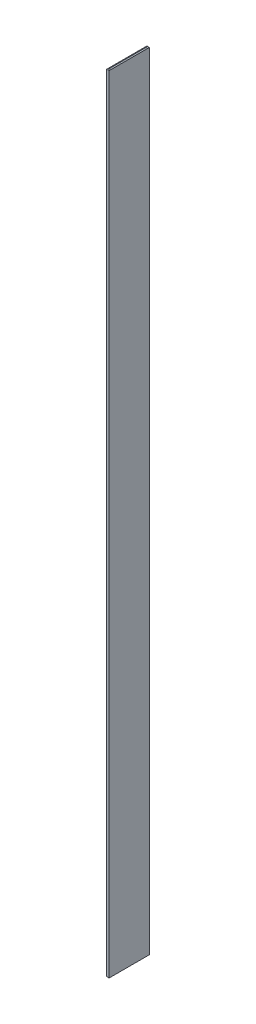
from build123d import *

# Parameters (mm, degrees)
SKETCH1_W           = 38.1
SKETCH1_H           = 609.6
BOSS_EXTRUDE1_DEPTH = 11946.825
CHAMFER1_SIZE       = 13


with BuildPart() as part:
    # Sketch1 → Boss-Extrude1 (new body)
    with BuildSketch(Plane(origin=(0, 0, 0), x_dir=(-1, 0, 0), z_dir=(0, 1, 0))):
        Rectangle(SKETCH1_W, SKETCH1_H)
    extrude(amount=BOSS_EXTRUDE1_DEPTH)

    # Chamfer1
    chamfer1_edges = [part.edges().sort_by_distance(p)[0] for p in [
        (19.05, 11946.825, 0),
        (0, 11946.825, -304.8),
        (-19.05, 11946.825, 0),
        (0, 0, -304.8),
        (19.05, 0, 0),
        (0, 0, 304.8),
        (-19.05, 0, 0),
        (0, 11946.825, 304.8),
    ]]
    chamfer(chamfer1_edges, length=CHAMFER1_SIZE)


solid = part.part
